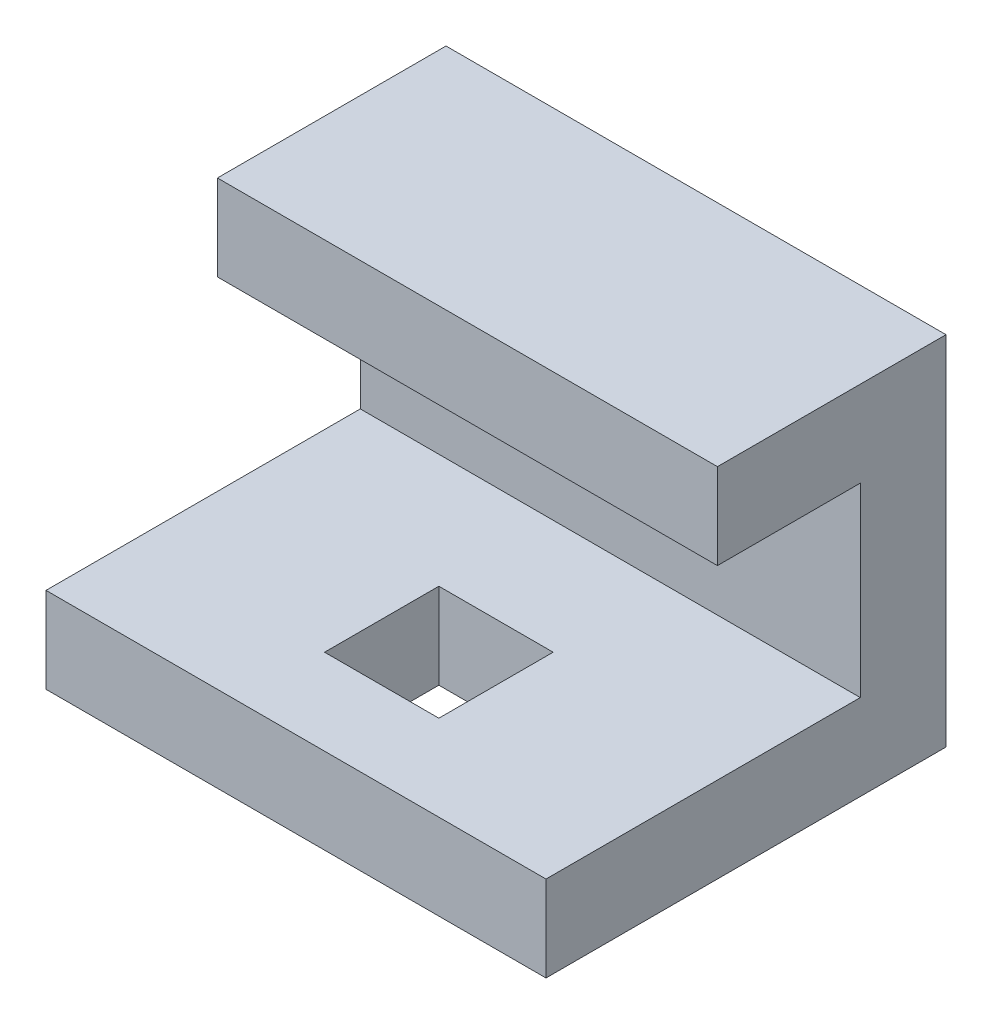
from build123d import *

# Parameters (mm, degrees)
ESBO_O1_W                = 70
ESBO_O1_H                = 50
RESSALTO_EXTRUS_O1_DEPTH = 56
ESBO_O2_W                = 44
ESBO_O2_H                = 26
CORTE_EXTRUS_O2_DEPTH    = 70
ESBO_O3_W                = 24
ESBO_O3_H                = 12
CORTE_EXTRUS_O5_DEPTH    = 103.645019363
ESBO_O4_W                = 16
ESBO_O4_H                = 16
CORTE_EXTRUS_O4_DEPTH    = 70


with BuildPart() as part:
    # Esbo_o1 → Ressalto-extrus_o1 (new body)
    with BuildSketch(Plane.XY):
        with Locations((35, -25)):
            Rectangle(ESBO_O1_W, ESBO_O1_H)
    extrude(amount=RESSALTO_EXTRUS_O1_DEPTH)

    # Esbo_o2 → Corte-extrus_o2 (cut)
    with BuildSketch(Plane.ZY):
        with Locations((34, -25)):
            Rectangle(ESBO_O2_W, ESBO_O2_H)
    extrude(amount=-CORTE_EXTRUS_O2_DEPTH, mode=Mode.SUBTRACT)

    # Esbo_o3 → Corte-extrus_o5 (cut, through all)
    with BuildSketch(Plane.ZY):
        with Locations((44, -6)):
            Rectangle(ESBO_O3_W, ESBO_O3_H)
    extrude(amount=-CORTE_EXTRUS_O5_DEPTH, mode=Mode.SUBTRACT)

    # Esbo_o4 → Corte-extrus_o4 (cut)
    with BuildSketch(Plane(origin=(0, -38, 0), x_dir=(1, 0, 0), z_dir=(0, 1, 0))):
        with Locations((35, -36)):
            Rectangle(ESBO_O4_W, ESBO_O4_H)
    extrude(amount=-CORTE_EXTRUS_O4_DEPTH, mode=Mode.SUBTRACT)


solid = part.part
